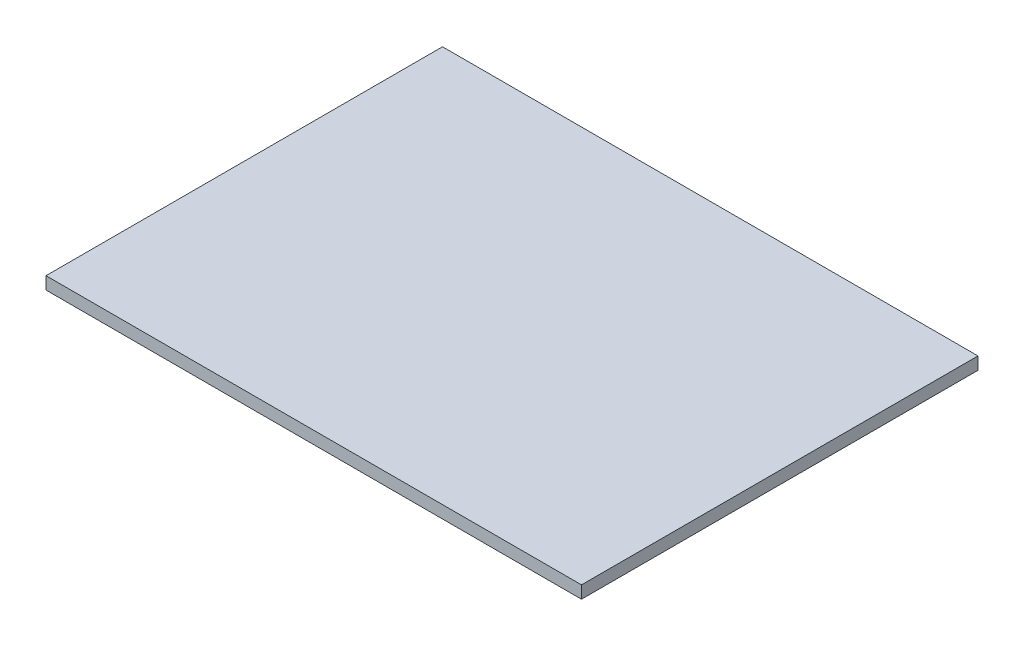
from build123d import *

# Parameters (mm, degrees)
SKETCH1_W           = 109.101270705
SKETCH1_H           = 80.78491037
BOSS_EXTRUDE1_DEPTH = 2.54


with BuildPart() as part:
    # Sketch1 → Boss-Extrude1 (new body)
    with BuildSketch(Plane(origin=(0, 0, 0), x_dir=(1, 0, 0), z_dir=(0, 1, 0))):
        with Locations((46.43050261, 28.7327774)):
            Rectangle(SKETCH1_W, SKETCH1_H)
    extrude(amount=BOSS_EXTRUDE1_DEPTH)


solid = part.part
